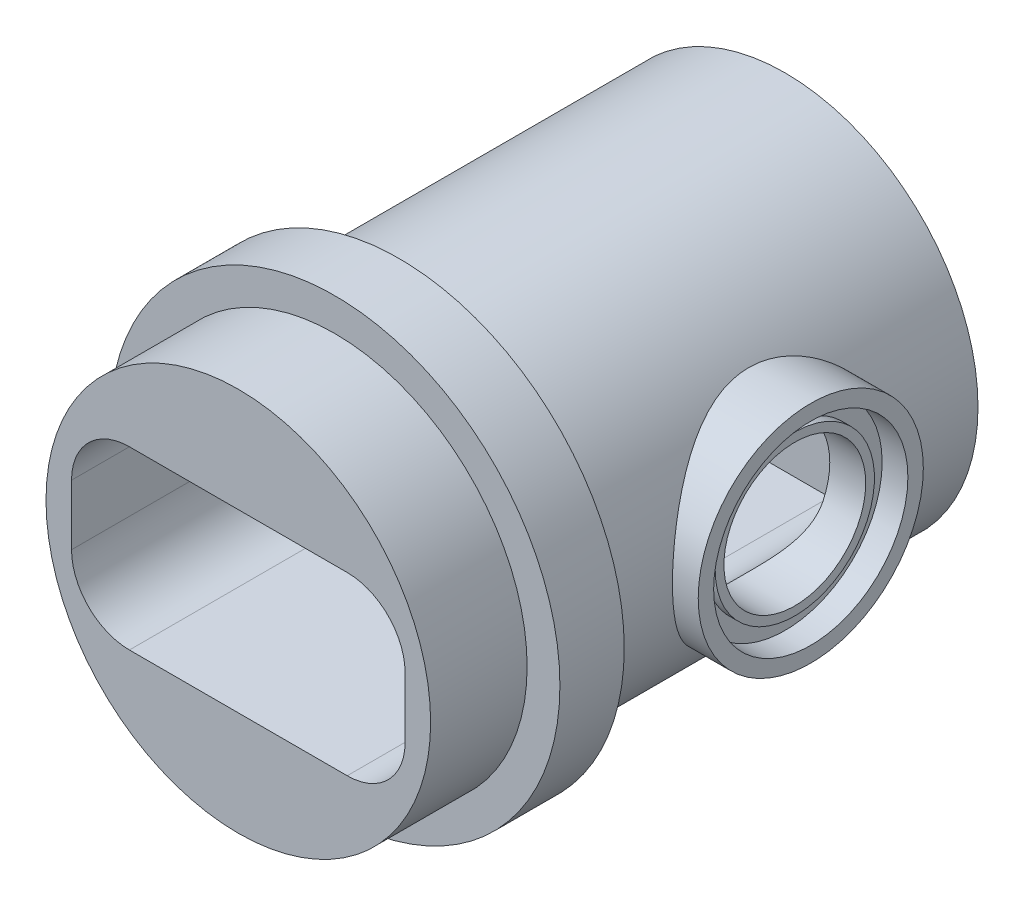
from build123d import *

# Parameters (mm, degrees)
SKETCH2_R           = 38.1
BOSS_EXTRUDE1_DEPTH = 76.2
SKETCH6_R           = 44.45
BOSS_EXTRUDE3_DEPTH = 12.7
SKETCH7_R           = 37.973
BOSS_EXTRUDE4_DEPTH = 19.05
SKETCH9_R           = 22.225
BOSS_EXTRUDE5_DEPTH = 15.24
SKETCH8_W           = 65.865
SKETCH8_H           = 34.75
CUT_EXTRUDE3_DEPTH  = 95.25
FILLET2_R           = 11.43
SKETCH10_R          = 14
CUT_EXTRUDE5_DEPTH  = 31.242
SKETCH11_R          = 19.177
CUT_EXTRUDE6_DEPTH  = 5.08
BOSS_EXTRUDE6_START = 1.9304
SKETCH12_R          = 15.7226
SKETCH12_R_2        = 14
BOSS_EXTRUDE6_DEPTH = 1.9304


with BuildPart() as part:
    # Sketch2 → Boss-Extrude1 (new body)
    with BuildSketch(Plane.XY):
        with Locations(Location((0, 0, 0), (0, 0, 180))):
            Circle(SKETCH2_R)
    extrude(amount=BOSS_EXTRUDE1_DEPTH)

    # Sketch6 → Boss-Extrude3 (add)
    with BuildSketch(Plane.XY.offset(76.2)):
        Circle(SKETCH6_R)
    extrude(amount=BOSS_EXTRUDE3_DEPTH)

    # Sketch7 → Boss-Extrude4 (add)
    with BuildSketch(Plane.XY.offset(88.9)):
        with Locations(Location((0, 0, 0), (0, 0, 180))):
            Circle(SKETCH7_R)
    extrude(amount=BOSS_EXTRUDE4_DEPTH)

    # Sketch9 → Boss-Extrude5 (add)
    with BuildSketch(Plane(origin=(43.18, 0, 0), x_dir=(0, 0, -1), z_dir=(1, 0, 0))):
        with Locations((-38.1, 0)):
            Circle(SKETCH9_R)
    extrude(amount=-BOSS_EXTRUDE5_DEPTH)

    # Sketch8 → Cut-Extrude3 (cut)
    with BuildSketch(Plane.XY.offset(107.95)):
        Rectangle(SKETCH8_W, SKETCH8_H)
    extrude(amount=-CUT_EXTRUDE3_DEPTH, mode=Mode.SUBTRACT)

    # Fillet2
    fillet2_edges = [part.edges().sort_by_distance(p)[0] for p in [
        (-32.9325, -17.375, 60.325),
        (-32.9325, 17.375, 60.325),
        (32.9325, 17.375, 60.325),
        (32.9325, -17.375, 60.325),
    ]]
    fillet(fillet2_edges, radius=FILLET2_R)

    # Sketch10 → Cut-Extrude5 (cut)
    with BuildSketch(Plane(origin=(43.18, 0, 0), x_dir=(0, 0, -1), z_dir=(1, 0, 0))):
        with Locations((-38.1, 0)):
            Circle(SKETCH10_R)
    extrude(amount=-CUT_EXTRUDE5_DEPTH, mode=Mode.SUBTRACT)

    # Sketch11 → Cut-Extrude6 (cut)
    with BuildSketch(Plane(origin=(43.18, 0, 0), x_dir=(0, 0, -1), z_dir=(1, 0, 0))):
        with Locations((-38.1, 0)):
            Circle(SKETCH11_R)
    extrude(amount=-CUT_EXTRUDE6_DEPTH, mode=Mode.SUBTRACT)

    # Sketch12 → Boss-Extrude6 (add)
    with BuildSketch(Plane(origin=(38.1, 0, 0), x_dir=(0, 0, -1), z_dir=(1, 0, 0)).offset(BOSS_EXTRUDE6_START)):
        with Locations(Location((-38.1, 0, 0), (0, 0, 180))):
            Circle(SKETCH12_R)
        with Locations((-38.1, 0)):
            Circle(SKETCH12_R_2, mode=Mode.SUBTRACT)
    extrude(amount=-BOSS_EXTRUDE6_DEPTH)


solid = part.part
